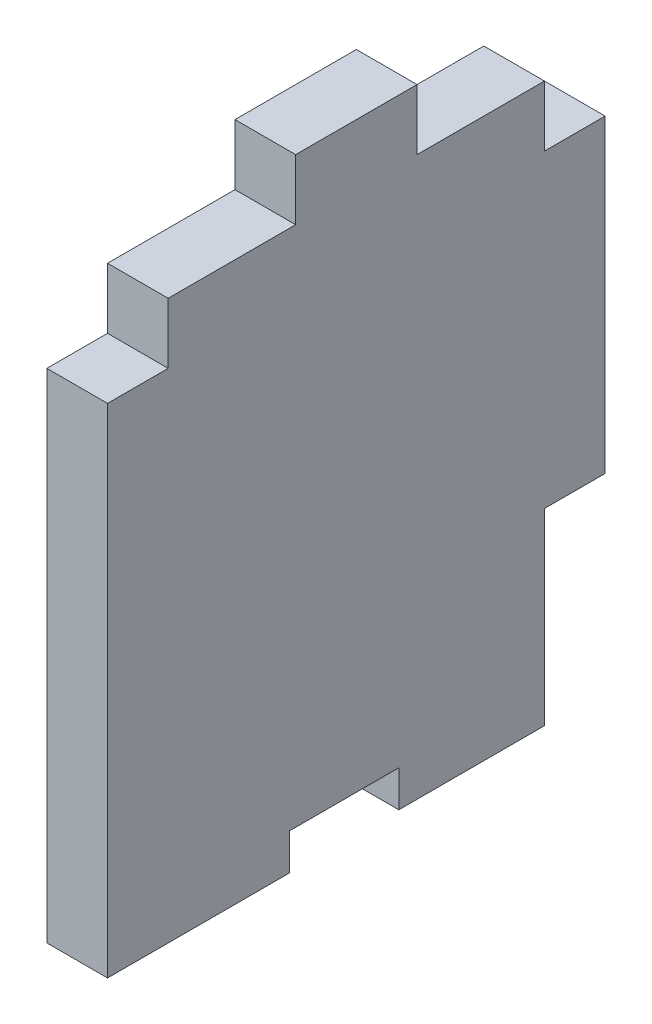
from build123d import *

# Parameters (mm, degrees)
ESQUISSE1_W             = 41
ESQUISSE1_H             = 51
BOSS_EXTRU_1_DEPTH      = 5
ENL_V_MAT_EXTRU_1_REACH = 35.098
ESQUISSE2_W             = 5
ESQUISSE2_H             = 15.5
ESQUISSE2_W_2           = 15.5
ESQUISSE2_H_2           = 5
ENL_V_MAT_EXTRU_2_REACH = 35.098
ESQUISSE3_W             = 5
ESQUISSE3_H             = 5
ENL_V_MAT_EXTRU_3_REACH = 35.098
ESQUISSE4_W             = 9
ESQUISSE4_H             = 3


with BuildPart() as part:
    # Esquisse1 → Boss.-Extru.1 (new body)
    with BuildSketch(Plane(origin=(0, 0, 0), x_dir=(0, 0, -1), z_dir=(1, 0, 0))):
        Rectangle(ESQUISSE1_W, ESQUISSE1_H)
    extrude(amount=BOSS_EXTRU_1_DEPTH)

    # Esquisse2 → Enl_v. mat.-Extru.1 (cut, up to next)
    with BuildSketch(Plane(origin=(5, 0, 0), x_dir=(0, 0, -1), z_dir=(1, 0, 0)), mode=Mode.PRIVATE) as enl_v_mat_extru_1_sk1:
        with Locations((18, -17.75)):
            Rectangle(ESQUISSE2_W, ESQUISSE2_H)
    enl_v_mat_extru_1_tool1 = extrude(enl_v_mat_extru_1_sk1.sketch, amount=-ENL_V_MAT_EXTRU_1_REACH, mode=Mode.PRIVATE) & part.part
    # Esquisse2 → Enl_v. mat.-Extru.1 (cut, up to next)
    with BuildSketch(Plane(origin=(5, 0, 0), x_dir=(0, 0, -1), z_dir=(1, 0, 0)), mode=Mode.PRIVATE) as enl_v_mat_extru_1_sk2:
        with Locations((-12.75, 23)):
            Rectangle(ESQUISSE2_W_2, ESQUISSE2_H_2)
    enl_v_mat_extru_1_tool2 = extrude(enl_v_mat_extru_1_sk2.sketch, amount=-ENL_V_MAT_EXTRU_1_REACH, mode=Mode.PRIVATE) & part.part
    # Esquisse2 → Enl_v. mat.-Extru.1 (cut, up to next)
    with BuildSketch(Plane(origin=(5, 0, 0), x_dir=(0, 0, -1), z_dir=(1, 0, 0)), mode=Mode.PRIVATE) as enl_v_mat_extru_1_sk3:
        with Locations((12.75, 23)):
            Rectangle(ESQUISSE2_W_2, ESQUISSE2_H_2)
    enl_v_mat_extru_1_tool3 = extrude(enl_v_mat_extru_1_sk3.sketch, amount=-ENL_V_MAT_EXTRU_1_REACH, mode=Mode.PRIVATE) & part.part
    add(enl_v_mat_extru_1_tool1.solids().sort_by_distance((5, -17.75, -18))[0], mode=Mode.SUBTRACT)
    add(enl_v_mat_extru_1_tool2.solids().sort_by_distance((5, 23, 12.75))[0], mode=Mode.SUBTRACT)
    add(enl_v_mat_extru_1_tool3.solids().sort_by_distance((5, 23, -12.75))[0], mode=Mode.SUBTRACT)

    # Esquisse3 → Enl_v. mat.-Extru.2 (cut, up to next)
    with BuildSketch(Plane(origin=(5, 0, 0), x_dir=(0, 0, -1), z_dir=(1, 0, 0)), mode=Mode.PRIVATE) as enl_v_mat_extru_2_sk1:
        with Locations((-18, 18)):
            Rectangle(ESQUISSE3_W, ESQUISSE3_H)
    enl_v_mat_extru_2_tool1 = extrude(enl_v_mat_extru_2_sk1.sketch, amount=-ENL_V_MAT_EXTRU_2_REACH, mode=Mode.PRIVATE) & part.part
    # Esquisse3 → Enl_v. mat.-Extru.2 (cut, up to next)
    with BuildSketch(Plane(origin=(5, 0, 0), x_dir=(0, 0, -1), z_dir=(1, 0, 0)), mode=Mode.PRIVATE) as enl_v_mat_extru_2_sk2:
        with Locations((18, 18)):
            Rectangle(ESQUISSE3_W, ESQUISSE3_H)
    enl_v_mat_extru_2_tool2 = extrude(enl_v_mat_extru_2_sk2.sketch, amount=-ENL_V_MAT_EXTRU_2_REACH, mode=Mode.PRIVATE) & part.part
    add(enl_v_mat_extru_2_tool1.solids().sort_by_distance((5, 18, 18))[0], mode=Mode.SUBTRACT)
    add(enl_v_mat_extru_2_tool2.solids().sort_by_distance((5, 18, -18))[0], mode=Mode.SUBTRACT)

    # Esquisse4 → Enl_v. mat.-Extru.3 (cut, up to next)
    with BuildSketch(Plane(origin=(5, 0, 0), x_dir=(0, 0, -1), z_dir=(1, 0, 0)), mode=Mode.PRIVATE) as enl_v_mat_extru_3_sk1:
        with Locations((-1, -24)):
            Rectangle(ESQUISSE4_W, ESQUISSE4_H)
    enl_v_mat_extru_3_tool1 = extrude(enl_v_mat_extru_3_sk1.sketch, amount=-ENL_V_MAT_EXTRU_3_REACH, mode=Mode.PRIVATE) & part.part
    add(enl_v_mat_extru_3_tool1.solids().sort_by_distance((5, -24, 1))[0], mode=Mode.SUBTRACT)


solid = part.part
